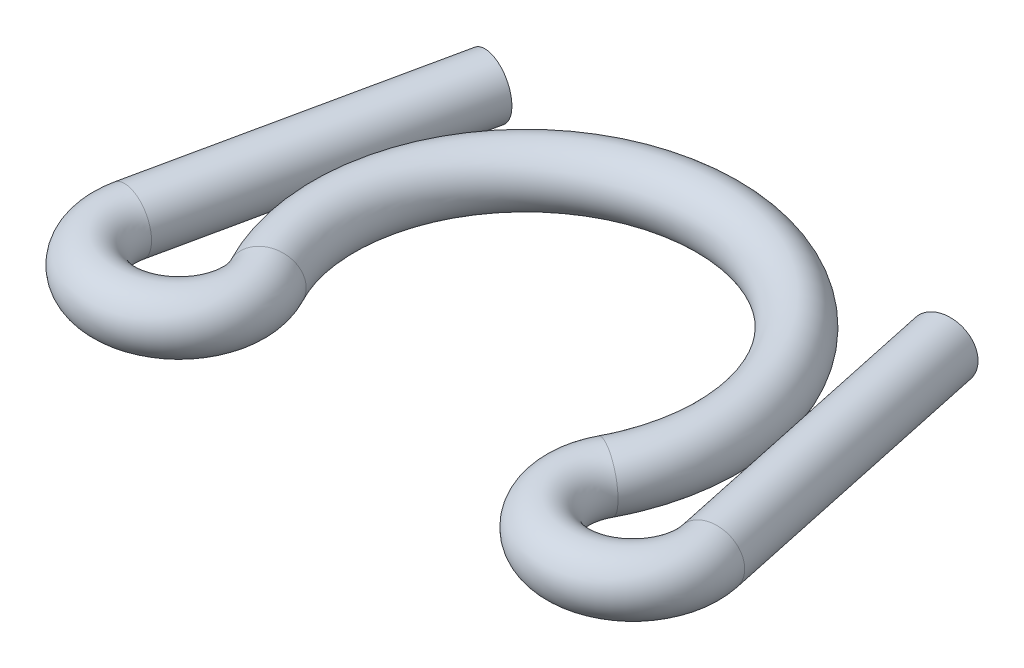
ISO-10303-21;
HEADER;
FILE_DESCRIPTION(('STEP AP214'),'2;1');
FILE_NAME('part.step','',(''),(''),'','','');
FILE_SCHEMA(('AUTOMOTIVE_DESIGN { 1 0 10303 214 1 1 1 1 }'));
ENDSEC;
DATA;
#1=APPLICATION_CONTEXT('core data for automotive mechanical design processes');
#2=APPLICATION_PROTOCOL_DEFINITION('international standard','automotive_design',2000,#1);
#3=PRODUCT_CONTEXT('',#1,'mechanical');
#4=PRODUCT('Part','Part','',(#3));
#5=PRODUCT_RELATED_PRODUCT_CATEGORY('part','',(#4));
#6=PRODUCT_DEFINITION_FORMATION('','',#4);
#7=PRODUCT_DEFINITION_CONTEXT('part definition',#1,'design');
#8=PRODUCT_DEFINITION('design','',#6,#7);
#9=PRODUCT_DEFINITION_SHAPE('','',#8);
#10=(LENGTH_UNIT() NAMED_UNIT(*) SI_UNIT(.MILLI.,.METRE.));
#11=(NAMED_UNIT(*) PLANE_ANGLE_UNIT() SI_UNIT($,.RADIAN.));
#12=(NAMED_UNIT(*) SI_UNIT($,.STERADIAN.) SOLID_ANGLE_UNIT());
#13=UNCERTAINTY_MEASURE_WITH_UNIT(LENGTH_MEASURE(1.E-05),#10,'distance_accuracy_value','');
#14=(GEOMETRIC_REPRESENTATION_CONTEXT(3) GLOBAL_UNCERTAINTY_ASSIGNED_CONTEXT((#13)) GLOBAL_UNIT_ASSIGNED_CONTEXT((#10,
#11,#12)) REPRESENTATION_CONTEXT('',''));
#15=CARTESIAN_POINT('',(0.,0.,0.));
#16=DIRECTION('',(0.,0.,1.));
#17=DIRECTION('',(1.,0.,0.));
#18=AXIS2_PLACEMENT_3D('',#15,#16,#17);
#19=CARTESIAN_POINT('',(41.8288963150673,0.,9.70827108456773));
#20=DIRECTION('',(-0.209101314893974,0.,-0.977893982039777));
#21=DIRECTION('',(-0.977893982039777,0.,0.209101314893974));
#22=AXIS2_PLACEMENT_3D('',#19,#20,#21);
#23=CYLINDRICAL_SURFACE('',#22,4.21072725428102);
#24=CARTESIAN_POINT('',(41.8288963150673,0.,9.70827108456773));
#25=DIRECTION('',(-0.20910131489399,0.,-0.977893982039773));
#26=DIRECTION('',(-0.977893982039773,0.,0.20910131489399));
#27=AXIS2_PLACEMENT_3D('',#24,#25,#26);
#28=CIRCLE('',#27,4.21072725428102);
#29=CARTESIAN_POINT('',(45.9465411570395,0.,8.82780247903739));
#30=VERTEX_POINT('',#29);
#31=EDGE_CURVE('E35',#30,#30,#28,.T.);
#32=ORIENTED_EDGE('',*,*,#31,.T.);
#33=EDGE_LOOP('',(#32));
#34=FACE_BOUND('',#33,.T.);
#35=CARTESIAN_POINT('',(32.6873730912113,0.,-33.0434473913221));
#36=DIRECTION('',(-0.20910131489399,0.,-0.977893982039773));
#37=DIRECTION('',(-0.977893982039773,0.,0.20910131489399));
#38=AXIS2_PLACEMENT_3D('',#35,#36,#37);
#39=CIRCLE('',#38,4.21072725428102);
#40=CARTESIAN_POINT('',(28.5697282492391,0.,-32.162978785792));
#41=VERTEX_POINT('',#40);
#42=EDGE_CURVE('E10',#41,#41,#39,.T.);
#43=ORIENTED_EDGE('',*,*,#42,.F.);
#44=EDGE_LOOP('',(#43));
#45=FACE_BOUND('',#44,.T.);
#46=ADVANCED_FACE('F29',(#34,#45),#23,.T.);
#47=CARTESIAN_POINT('',(32.6873730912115,0.,11.6629865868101));
#48=DIRECTION('',(0.,1.,0.));
#49=DIRECTION('',(0.,0.,1.));
#50=AXIS2_PLACEMENT_3D('',#47,#48,#49);
#51=TOROIDAL_SURFACE('',#50,9.34817412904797,4.21072725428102);
#52=CARTESIAN_POINT('',(24.4172178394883,0.,7.30490310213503));
#53=DIRECTION('',(-0.466196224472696,0.,0.884681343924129));
#54=DIRECTION('',(0.884681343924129,0.,0.466196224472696));
#55=AXIS2_PLACEMENT_3D('',#52,#53,#54);
#56=CIRCLE('',#55,4.21072725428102);
#57=CARTESIAN_POINT('',(20.6920659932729,0.,5.34187795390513));
#58=VERTEX_POINT('',#57);
#59=EDGE_CURVE('E39',#58,#58,#56,.T.);
#60=CARTESIAN_POINT('',(32.6873730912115,0.,11.6629865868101));
#61=DIRECTION('',(0.,1.,0.));
#62=DIRECTION('',(0.,0.,1.));
#63=AXIS2_PLACEMENT_3D('',#60,#61,#62);
#64=CIRCLE('',#63,13.558901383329);
#65=EDGE_CURVE('',#58,#30,#64,.T.);
#66=ORIENTED_EDGE('',*,*,#59,.T.);
#67=ORIENTED_EDGE('',*,*,#31,.F.);
#68=ORIENTED_EDGE('',*,*,#65,.T.);
#69=ORIENTED_EDGE('',*,*,#65,.F.);
#70=EDGE_LOOP('',(#66,#68,#67,#69));
#71=FACE_BOUND('',#70,.T.);
#72=ADVANCED_FACE('F66',(#71),#51,.T.);
#73=CARTESIAN_POINT('',(0.,0.,-5.56211941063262));
#74=DIRECTION('',(0.,-1.,0.));
#75=DIRECTION('',(0.,0.,-1.));
#76=AXIS2_PLACEMENT_3D('',#73,#74,#75);
#77=TOROIDAL_SURFACE('',#76,27.6000144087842,4.21072725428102);
#78=CARTESIAN_POINT('',(-24.4172178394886,0.,7.3049031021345));
#79=DIRECTION('',(-0.466196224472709,0.,-0.884681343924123));
#80=DIRECTION('',(-0.884681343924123,0.,0.466196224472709));
#81=AXIS2_PLACEMENT_3D('',#78,#79,#80);
#82=CIRCLE('',#81,4.21072725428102);
#83=CARTESIAN_POINT('',(-20.6920659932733,0.,5.34187795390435));
#84=VERTEX_POINT('',#83);
#85=EDGE_CURVE('E43',#84,#84,#82,.T.);
#86=ORIENTED_EDGE('',*,*,#85,.T.);
#87=EDGE_LOOP('',(#86));
#88=FACE_BOUND('',#87,.T.);
#89=ORIENTED_EDGE('',*,*,#59,.F.);
#90=EDGE_LOOP('',(#89));
#91=FACE_BOUND('',#90,.T.);
#92=ADVANCED_FACE('F70',(#88,#91),#77,.T.);
#93=CARTESIAN_POINT('',(-32.6873730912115,0.,11.6629865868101));
#94=DIRECTION('',(0.,1.,0.));
#95=DIRECTION('',(0.,0.,1.));
#96=AXIS2_PLACEMENT_3D('',#93,#94,#95);
#97=TOROIDAL_SURFACE('',#96,9.34817412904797,4.21072725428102);
#98=CARTESIAN_POINT('',(-41.8288963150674,0.,9.70827108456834));
#99=DIRECTION('',(-0.209101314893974,0.,0.977893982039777));
#100=DIRECTION('',(0.977893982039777,0.,0.209101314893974));
#101=AXIS2_PLACEMENT_3D('',#98,#99,#100);
#102=CIRCLE('',#101,4.21072725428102);
#103=CARTESIAN_POINT('',(-45.9465411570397,0.,8.82780247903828));
#104=VERTEX_POINT('',#103);
#105=EDGE_CURVE('E48',#104,#104,#102,.T.);
#106=CARTESIAN_POINT('',(-32.6873730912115,0.,11.6629865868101));
#107=DIRECTION('',(0.,1.,0.));
#108=DIRECTION('',(0.,0.,1.));
#109=AXIS2_PLACEMENT_3D('',#106,#107,#108);
#110=CIRCLE('',#109,13.558901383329);
#111=EDGE_CURVE('',#104,#84,#110,.T.);
#112=ORIENTED_EDGE('',*,*,#105,.T.);
#113=ORIENTED_EDGE('',*,*,#85,.F.);
#114=ORIENTED_EDGE('',*,*,#111,.T.);
#115=ORIENTED_EDGE('',*,*,#111,.F.);
#116=EDGE_LOOP('',(#112,#114,#113,#115));
#117=FACE_BOUND('',#116,.T.);
#118=ADVANCED_FACE('F76',(#117),#97,.T.);
#119=CARTESIAN_POINT('',(-41.8288963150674,0.,9.70827108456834));
#120=DIRECTION('',(0.209101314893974,0.,-0.977893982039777));
#121=DIRECTION('',(-0.977893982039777,0.,-0.209101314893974));
#122=AXIS2_PLACEMENT_3D('',#119,#120,#121);
#123=CYLINDRICAL_SURFACE('',#122,4.21072725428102);
#124=ORIENTED_EDGE('',*,*,#105,.F.);
#125=EDGE_LOOP('',(#124));
#126=FACE_BOUND('',#125,.T.);
#127=CARTESIAN_POINT('',(-32.6873730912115,0.,-33.0434473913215));
#128=DIRECTION('',(-0.209101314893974,0.,0.977893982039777));
#129=DIRECTION('',(0.977893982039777,0.,0.209101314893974));
#130=AXIS2_PLACEMENT_3D('',#127,#128,#129);
#131=CIRCLE('',#130,4.21072725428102);
#132=CARTESIAN_POINT('',(-28.5697282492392,0.,-32.1629787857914));
#133=VERTEX_POINT('',#132);
#134=EDGE_CURVE('E51',#133,#133,#131,.T.);
#135=ORIENTED_EDGE('',*,*,#134,.T.);
#136=EDGE_LOOP('',(#135));
#137=FACE_BOUND('',#136,.T.);
#138=ADVANCED_FACE('F55',(#126,#137),#123,.T.);
#139=CARTESIAN_POINT('',(32.6873730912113,0.,-33.0434473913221));
#140=DIRECTION('',(-0.20910131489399,0.,-0.977893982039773));
#141=DIRECTION('',(-0.977893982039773,0.,0.20910131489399));
#142=AXIS2_PLACEMENT_3D('',#139,#140,#141);
#143=PLANE('',#142);
#144=ORIENTED_EDGE('',*,*,#42,.T.);
#145=EDGE_LOOP('',(#144));
#146=FACE_BOUND('',#145,.T.);
#147=ADVANCED_FACE('F59',(#146),#143,.T.);
#148=CARTESIAN_POINT('',(-32.6873730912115,0.,-33.0434473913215));
#149=DIRECTION('',(-0.209101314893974,0.,0.977893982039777));
#150=DIRECTION('',(0.977893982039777,0.,0.209101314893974));
#151=AXIS2_PLACEMENT_3D('',#148,#149,#150);
#152=PLANE('',#151);
#153=ORIENTED_EDGE('',*,*,#134,.F.);
#154=EDGE_LOOP('',(#153));
#155=FACE_BOUND('',#154,.T.);
#156=ADVANCED_FACE('F57',(#155),#152,.F.);
#157=CLOSED_SHELL('',(#46,#72,#92,#118,#138,#147,#156));
#158=MANIFOLD_SOLID_BREP('B2',#157);
#159=ADVANCED_BREP_SHAPE_REPRESENTATION('',(#18,#158),#14);
#160=SHAPE_DEFINITION_REPRESENTATION(#9,#159);
ENDSEC;
END-ISO-10303-21;
